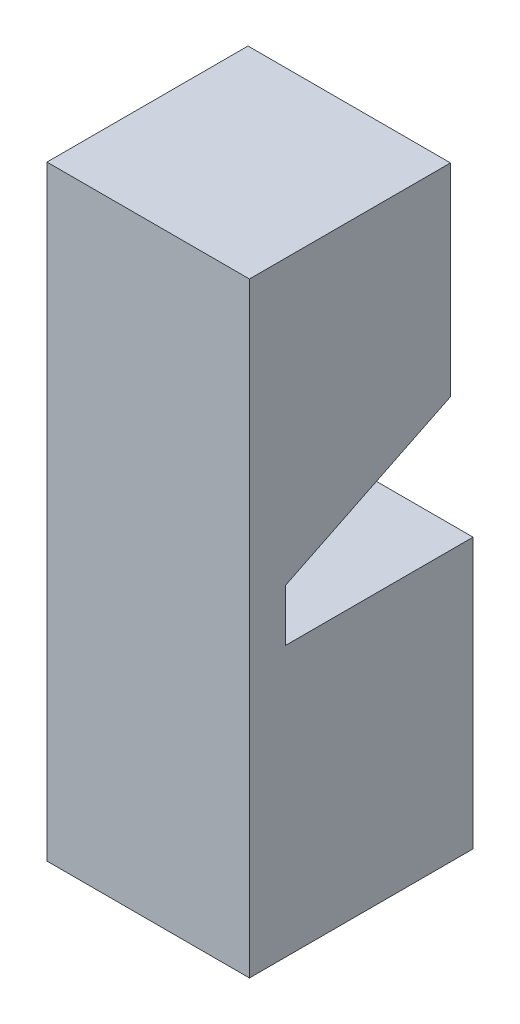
from build123d import *

# Parameters (mm, degrees)
BOSS_EXTRUDE1_DEPTH = 609.6


with BuildPart() as part:
    # Sketch1 → Boss-Extrude1 (new body)
    with BuildSketch(Plane(origin=(0, 0, 0), x_dir=(0, 0, -1), z_dir=(1, 0, 0))):
        Polygon((108.963945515, 969.652240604), (605.189394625, 1212.85), (605.189394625, 1822.45), (0, 1822.45), (0, 0), (673.1, 0), (673.1, 812.8), (108.963945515, 812.8), align=None)
    extrude(amount=BOSS_EXTRUDE1_DEPTH)


solid = part.part
